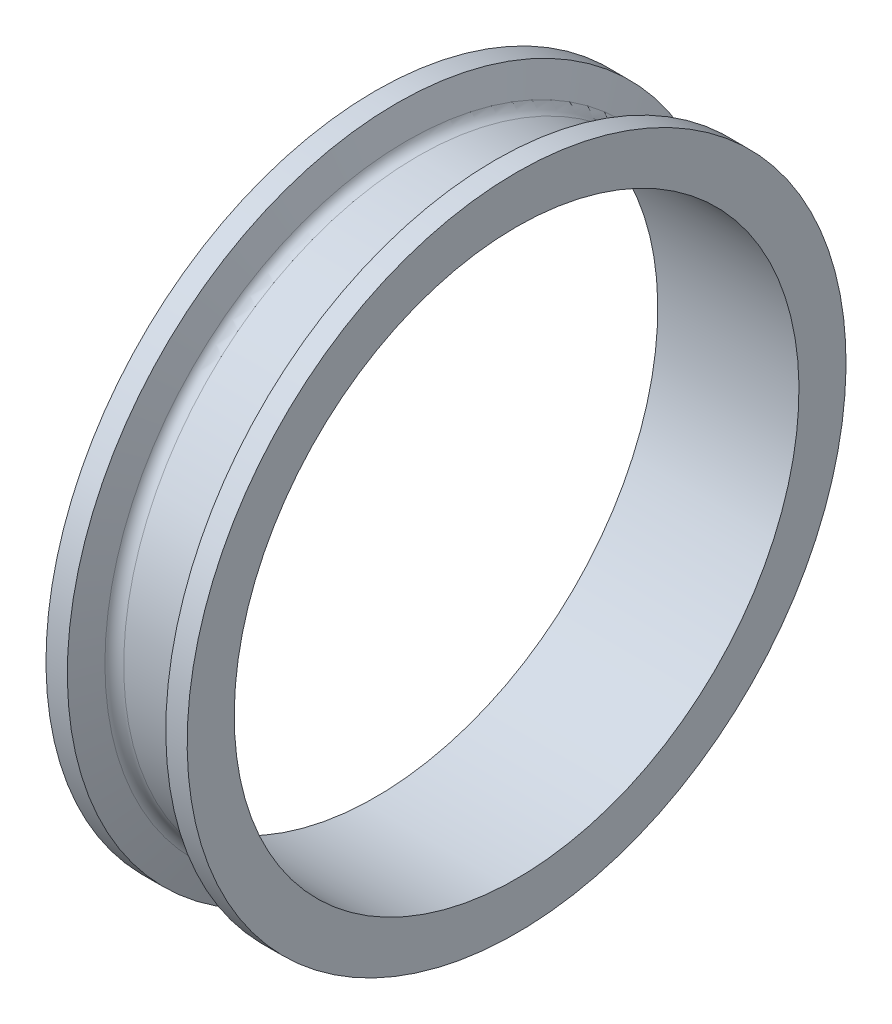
ISO-10303-21;
HEADER;
FILE_DESCRIPTION(('STEP AP214'),'2;1');
FILE_NAME('part.step','',(''),(''),'','','');
FILE_SCHEMA(('AUTOMOTIVE_DESIGN { 1 0 10303 214 1 1 1 1 }'));
ENDSEC;
DATA;
#1=APPLICATION_CONTEXT('core data for automotive mechanical design processes');
#2=APPLICATION_PROTOCOL_DEFINITION('international standard','automotive_design',2000,#1);
#3=PRODUCT_CONTEXT('',#1,'mechanical');
#4=PRODUCT('Part','Part','',(#3));
#5=PRODUCT_RELATED_PRODUCT_CATEGORY('part','',(#4));
#6=PRODUCT_DEFINITION_FORMATION('','',#4);
#7=PRODUCT_DEFINITION_CONTEXT('part definition',#1,'design');
#8=PRODUCT_DEFINITION('design','',#6,#7);
#9=PRODUCT_DEFINITION_SHAPE('','',#8);
#10=(LENGTH_UNIT() NAMED_UNIT(*) SI_UNIT(.MILLI.,.METRE.));
#11=(NAMED_UNIT(*) PLANE_ANGLE_UNIT() SI_UNIT($,.RADIAN.));
#12=(NAMED_UNIT(*) SI_UNIT($,.STERADIAN.) SOLID_ANGLE_UNIT());
#13=UNCERTAINTY_MEASURE_WITH_UNIT(LENGTH_MEASURE(1.E-05),#10,'distance_accuracy_value','');
#14=(GEOMETRIC_REPRESENTATION_CONTEXT(3) GLOBAL_UNCERTAINTY_ASSIGNED_CONTEXT((#13)) GLOBAL_UNIT_ASSIGNED_CONTEXT((#10,
#11,#12)) REPRESENTATION_CONTEXT('',''));
#15=CARTESIAN_POINT('',(0.,0.,0.));
#16=DIRECTION('',(0.,0.,1.));
#17=DIRECTION('',(1.,0.,0.));
#18=AXIS2_PLACEMENT_3D('',#15,#16,#17);
#19=CARTESIAN_POINT('',(19.05,88.9,0.));
#20=DIRECTION('',(1.,0.,0.));
#21=DIRECTION('',(0.,1.,0.));
#22=AXIS2_PLACEMENT_3D('',#19,#20,#21);
#23=PLANE('',#22);
#24=CARTESIAN_POINT('',(19.05,0.,0.));
#25=DIRECTION('',(1.,0.,0.));
#26=DIRECTION('',(0.,1.,0.));
#27=AXIS2_PLACEMENT_3D('',#24,#25,#26);
#28=CIRCLE('',#27,88.9);
#29=CARTESIAN_POINT('',(19.05,88.9,0.));
#30=VERTEX_POINT('',#29);
#31=EDGE_CURVE('E10',#30,#30,#28,.T.);
#32=ORIENTED_EDGE('',*,*,#31,.T.);
#33=EDGE_LOOP('',(#32));
#34=FACE_BOUND('',#33,.T.);
#35=CARTESIAN_POINT('',(19.05,0.,0.));
#36=DIRECTION('',(1.,0.,0.));
#37=DIRECTION('',(0.,1.,0.));
#38=AXIS2_PLACEMENT_3D('',#35,#36,#37);
#39=CIRCLE('',#38,76.2);
#40=CARTESIAN_POINT('',(19.05,76.2,0.));
#41=VERTEX_POINT('',#40);
#42=EDGE_CURVE('E66',#41,#41,#39,.T.);
#43=ORIENTED_EDGE('',*,*,#42,.F.);
#44=EDGE_LOOP('',(#43));
#45=FACE_BOUND('',#44,.T.);
#46=ADVANCED_FACE('F32',(#34,#45),#23,.T.);
#47=CARTESIAN_POINT('',(22.450298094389,0.,0.));
#48=DIRECTION('',(1.,0.,0.));
#49=DIRECTION('',(0.,1.,0.));
#50=AXIS2_PLACEMENT_3D('',#47,#48,#49);
#51=CYLINDRICAL_SURFACE('',#50,88.9);
#52=CARTESIAN_POINT('',(13.2842,0.,0.));
#53=DIRECTION('',(1.,0.,0.));
#54=DIRECTION('',(0.,1.,0.));
#55=AXIS2_PLACEMENT_3D('',#52,#53,#54);
#56=CIRCLE('',#55,88.9);
#57=CARTESIAN_POINT('',(13.2842,88.9,0.));
#58=VERTEX_POINT('',#57);
#59=EDGE_CURVE('E38',#58,#58,#56,.T.);
#60=ORIENTED_EDGE('',*,*,#59,.T.);
#61=EDGE_LOOP('',(#60));
#62=FACE_BOUND('',#61,.T.);
#63=ORIENTED_EDGE('',*,*,#31,.F.);
#64=EDGE_LOOP('',(#63));
#65=FACE_BOUND('',#64,.T.);
#66=ADVANCED_FACE('F74',(#62,#65),#51,.T.);
#67=CARTESIAN_POINT('',(13.2842,0.,0.));
#68=DIRECTION('',(1.,0.,0.));
#69=DIRECTION('',(0.,1.,0.));
#70=AXIS2_PLACEMENT_3D('',#67,#68,#69);
#71=CONICAL_SURFACE('',#70,88.9,1.22173047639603);
#72=CARTESIAN_POINT('',(10.5777486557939,0.,0.));
#73=DIRECTION('',(1.,0.,0.));
#74=DIRECTION('',(0.,1.,0.));
#75=AXIS2_PLACEMENT_3D('',#72,#73,#74);
#76=CIRCLE('',#75,81.4640860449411);
#77=CARTESIAN_POINT('',(10.5777486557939,81.4640860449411,0.));
#78=VERTEX_POINT('',#77);
#79=EDGE_CURVE('E42',#78,#78,#76,.T.);
#80=ORIENTED_EDGE('',*,*,#79,.T.);
#81=EDGE_LOOP('',(#80));
#82=FACE_BOUND('',#81,.T.);
#83=ORIENTED_EDGE('',*,*,#59,.F.);
#84=EDGE_LOOP('',(#83));
#85=FACE_BOUND('',#84,.T.);
#86=ADVANCED_FACE('F78',(#82,#85),#71,.T.);
#87=CARTESIAN_POINT('',(7.59422458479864,0.,0.));
#88=DIRECTION('',(1.,0.,0.));
#89=DIRECTION('',(0.,1.,0.));
#90=AXIS2_PLACEMENT_3D('',#87,#88,#89);
#91=TOROIDAL_SURFACE('',#90,82.55,3.17499999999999);
#92=CARTESIAN_POINT('',(7.59422458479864,0.,0.));
#93=DIRECTION('',(1.,0.,0.));
#94=DIRECTION('',(0.,1.,0.));
#95=AXIS2_PLACEMENT_3D('',#92,#93,#94);
#96=CIRCLE('',#95,79.375);
#97=CARTESIAN_POINT('',(7.59422458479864,79.375,0.));
#98=VERTEX_POINT('',#97);
#99=EDGE_CURVE('E46',#98,#98,#96,.T.);
#100=ORIENTED_EDGE('',*,*,#99,.T.);
#101=EDGE_LOOP('',(#100));
#102=FACE_BOUND('',#101,.T.);
#103=ORIENTED_EDGE('',*,*,#79,.F.);
#104=EDGE_LOOP('',(#103));
#105=FACE_BOUND('',#104,.T.);
#106=ADVANCED_FACE('F82',(#102,#105),#91,.F.);
#107=CARTESIAN_POINT('',(22.450298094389,0.,0.));
#108=DIRECTION('',(1.,0.,0.));
#109=DIRECTION('',(0.,1.,0.));
#110=AXIS2_PLACEMENT_3D('',#107,#108,#109);
#111=CYLINDRICAL_SURFACE('',#110,79.375);
#112=CARTESIAN_POINT('',(-7.59422458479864,0.,0.));
#113=DIRECTION('',(1.,0.,0.));
#114=DIRECTION('',(0.,1.,0.));
#115=AXIS2_PLACEMENT_3D('',#112,#113,#114);
#116=CIRCLE('',#115,79.375);
#117=CARTESIAN_POINT('',(-7.59422458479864,79.375,0.));
#118=VERTEX_POINT('',#117);
#119=EDGE_CURVE('E51',#118,#118,#116,.T.);
#120=ORIENTED_EDGE('',*,*,#119,.T.);
#121=EDGE_LOOP('',(#120));
#122=FACE_BOUND('',#121,.T.);
#123=ORIENTED_EDGE('',*,*,#99,.F.);
#124=EDGE_LOOP('',(#123));
#125=FACE_BOUND('',#124,.T.);
#126=ADVANCED_FACE('F89',(#122,#125),#111,.T.);
#127=CARTESIAN_POINT('',(-7.59422458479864,0.,0.));
#128=DIRECTION('',(1.,0.,0.));
#129=DIRECTION('',(0.,1.,0.));
#130=AXIS2_PLACEMENT_3D('',#127,#128,#129);
#131=TOROIDAL_SURFACE('',#130,82.55,3.17499999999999);
#132=CARTESIAN_POINT('',(-10.5777486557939,0.,0.));
#133=DIRECTION('',(1.,0.,0.));
#134=DIRECTION('',(0.,1.,0.));
#135=AXIS2_PLACEMENT_3D('',#132,#133,#134);
#136=CIRCLE('',#135,81.4640860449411);
#137=CARTESIAN_POINT('',(-10.5777486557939,81.4640860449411,0.));
#138=VERTEX_POINT('',#137);
#139=EDGE_CURVE('E54',#138,#138,#136,.T.);
#140=ORIENTED_EDGE('',*,*,#139,.T.);
#141=EDGE_LOOP('',(#140));
#142=FACE_BOUND('',#141,.T.);
#143=ORIENTED_EDGE('',*,*,#119,.F.);
#144=EDGE_LOOP('',(#143));
#145=FACE_BOUND('',#144,.T.);
#146=ADVANCED_FACE('F93',(#142,#145),#131,.F.);
#147=CARTESIAN_POINT('',(-10.5777486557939,0.,0.));
#148=DIRECTION('',(-1.,0.,0.));
#149=DIRECTION('',(0.,-1.,0.));
#150=AXIS2_PLACEMENT_3D('',#147,#148,#149);
#151=CONICAL_SURFACE('',#150,81.4640860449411,1.22173047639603);
#152=CARTESIAN_POINT('',(-13.2842,0.,0.));
#153=DIRECTION('',(1.,0.,0.));
#154=DIRECTION('',(0.,1.,0.));
#155=AXIS2_PLACEMENT_3D('',#152,#153,#154);
#156=CIRCLE('',#155,88.9);
#157=CARTESIAN_POINT('',(-13.2842,88.9,0.));
#158=VERTEX_POINT('',#157);
#159=EDGE_CURVE('E57',#158,#158,#156,.T.);
#160=ORIENTED_EDGE('',*,*,#159,.T.);
#161=EDGE_LOOP('',(#160));
#162=FACE_BOUND('',#161,.T.);
#163=ORIENTED_EDGE('',*,*,#139,.F.);
#164=EDGE_LOOP('',(#163));
#165=FACE_BOUND('',#164,.T.);
#166=ADVANCED_FACE('F97',(#162,#165),#151,.T.);
#167=CARTESIAN_POINT('',(22.450298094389,0.,0.));
#168=DIRECTION('',(1.,0.,0.));
#169=DIRECTION('',(0.,1.,0.));
#170=AXIS2_PLACEMENT_3D('',#167,#168,#169);
#171=CYLINDRICAL_SURFACE('',#170,88.9);
#172=CARTESIAN_POINT('',(-19.05,0.,0.));
#173=DIRECTION('',(1.,0.,0.));
#174=DIRECTION('',(0.,1.,0.));
#175=AXIS2_PLACEMENT_3D('',#172,#173,#174);
#176=CIRCLE('',#175,88.9);
#177=CARTESIAN_POINT('',(-19.05,88.9,0.));
#178=VERTEX_POINT('',#177);
#179=EDGE_CURVE('E60',#178,#178,#176,.T.);
#180=ORIENTED_EDGE('',*,*,#179,.T.);
#181=EDGE_LOOP('',(#180));
#182=FACE_BOUND('',#181,.T.);
#183=ORIENTED_EDGE('',*,*,#159,.F.);
#184=EDGE_LOOP('',(#183));
#185=FACE_BOUND('',#184,.T.);
#186=ADVANCED_FACE('F101',(#182,#185),#171,.T.);
#187=CARTESIAN_POINT('',(-19.05,88.9,0.));
#188=DIRECTION('',(-1.,0.,0.));
#189=DIRECTION('',(0.,-1.,0.));
#190=AXIS2_PLACEMENT_3D('',#187,#188,#189);
#191=PLANE('',#190);
#192=CARTESIAN_POINT('',(-19.05,0.,0.));
#193=DIRECTION('',(1.,0.,0.));
#194=DIRECTION('',(0.,1.,0.));
#195=AXIS2_PLACEMENT_3D('',#192,#193,#194);
#196=CIRCLE('',#195,76.2);
#197=CARTESIAN_POINT('',(-19.05,76.2,0.));
#198=VERTEX_POINT('',#197);
#199=EDGE_CURVE('E63',#198,#198,#196,.T.);
#200=ORIENTED_EDGE('',*,*,#199,.T.);
#201=EDGE_LOOP('',(#200));
#202=FACE_BOUND('',#201,.T.);
#203=ORIENTED_EDGE('',*,*,#179,.F.);
#204=EDGE_LOOP('',(#203));
#205=FACE_BOUND('',#204,.T.);
#206=ADVANCED_FACE('F105',(#202,#205),#191,.T.);
#207=CARTESIAN_POINT('',(22.450298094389,0.,0.));
#208=DIRECTION('',(1.,0.,0.));
#209=DIRECTION('',(0.,1.,0.));
#210=AXIS2_PLACEMENT_3D('',#207,#208,#209);
#211=CYLINDRICAL_SURFACE('',#210,76.2);
#212=ORIENTED_EDGE('',*,*,#42,.T.);
#213=EDGE_LOOP('',(#212));
#214=FACE_BOUND('',#213,.T.);
#215=ORIENTED_EDGE('',*,*,#199,.F.);
#216=EDGE_LOOP('',(#215));
#217=FACE_BOUND('',#216,.T.);
#218=ADVANCED_FACE('F70',(#214,#217),#211,.F.);
#219=CLOSED_SHELL('',(#46,#66,#86,#106,#126,#146,#166,#186,#206,#218));
#220=MANIFOLD_SOLID_BREP('B2',#219);
#221=ADVANCED_BREP_SHAPE_REPRESENTATION('',(#18,#220),#14);
#222=SHAPE_DEFINITION_REPRESENTATION(#9,#221);
ENDSEC;
END-ISO-10303-21;
